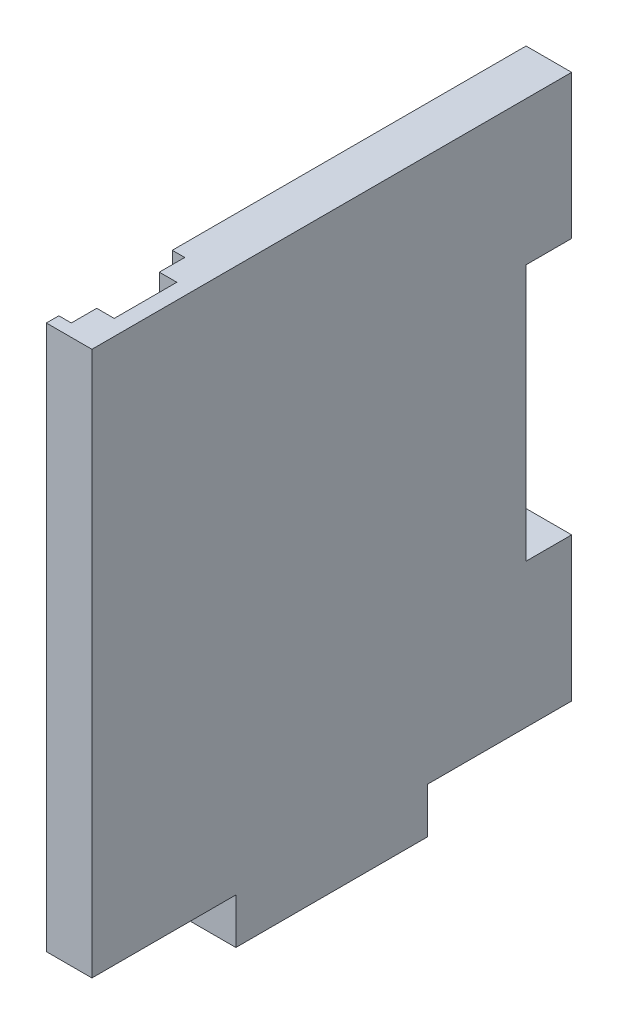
from build123d import *

# Parameters (mm, degrees)
ESQUISSE1_W             = 200
ESQUISSE1_H             = 246
BOSS_EXTRU_1_DEPTH      = 9.5
ENL_V_MAT_EXTRU_1_REACH = 161.656
ESQUISSE2_W             = 19
ESQUISSE2_H             = 107
ENL_V_MAT_EXTRU_2_REACH = 161.656
ESQUISSE3_W             = 60
ESQUISSE3_H             = 19
ESQUISSE4_W             = 47.3
ESQUISSE4_H             = 227
ENL_V_MAT_EXTRU_3_DEPTH = 5.2
ESQUISSE5_W             = 26.1
ESQUISSE5_H             = 227
ENL_V_MAT_EXTRU_4_DEPTH = 12.5


with BuildPart() as part:
    # Esquisse1 → Boss.-Extru.1 (new, symmetric)
    with BuildSketch(Plane(origin=(0, 0, 0), x_dir=(0, 0, -1), z_dir=(1, 0, 0))):
        Rectangle(ESQUISSE1_W, ESQUISSE1_H)
    extrude(amount=BOSS_EXTRU_1_DEPTH, both=True)

    # Esquisse2 → Enl_v. mat.-Extru.1 (cut, up to next)
    with BuildSketch(Plane(origin=(9.5, 0, 0), x_dir=(0, 0, -1), z_dir=(1, 0, 0)), mode=Mode.PRIVATE) as enl_v_mat_extru_1_sk1:
        with Locations((90.5, 9.5)):
            Rectangle(ESQUISSE2_W, ESQUISSE2_H)
    enl_v_mat_extru_1_tool1 = extrude(enl_v_mat_extru_1_sk1.sketch, amount=-ENL_V_MAT_EXTRU_1_REACH, mode=Mode.PRIVATE) & part.part
    add(enl_v_mat_extru_1_tool1.solids().sort_by_distance((9.5, 9.5, -90.5))[0], mode=Mode.SUBTRACT)

    # Esquisse3 → Enl_v. mat.-Extru.2 (cut, up to next)
    with BuildSketch(Plane(origin=(9.5, 0, 0), x_dir=(0, 0, -1), z_dir=(1, 0, 0)), mode=Mode.PRIVATE) as enl_v_mat_extru_2_sk1:
        with Locations((70, -113.5)):
            Rectangle(ESQUISSE3_W, ESQUISSE3_H)
    enl_v_mat_extru_2_tool1 = extrude(enl_v_mat_extru_2_sk1.sketch, amount=-ENL_V_MAT_EXTRU_2_REACH, mode=Mode.PRIVATE) & part.part
    enl_v_mat_extru_2 = enl_v_mat_extru_2_tool1.solids().sort_by_distance((9.5, -113.5, -70))[0]
    add(enl_v_mat_extru_2, mode=Mode.SUBTRACT)

    # Sym_trie1: Enl_v. mat.-Extru.2 across plane
    add(enl_v_mat_extru_2.mirror(Plane.XY), mode=Mode.SUBTRACT)

    # Esquisse4 → Enl_v. mat.-Extru.3 (cut)
    with BuildSketch(Plane.ZY.offset(9.5)):
        with Locations((71.15, 9.5)):
            Rectangle(ESQUISSE4_W, ESQUISSE4_H)
    extrude(amount=-ENL_V_MAT_EXTRU_3_DEPTH, mode=Mode.SUBTRACT)

    # Esquisse5 → Enl_v. mat.-Extru.4 (cut)
    with BuildSketch(Plane.ZY.offset(9.5)):
        with Locations((71.15, 9.5)):
            Rectangle(ESQUISSE5_W, ESQUISSE5_H)
    extrude(amount=-ENL_V_MAT_EXTRU_4_DEPTH, mode=Mode.SUBTRACT)


solid = part.part
